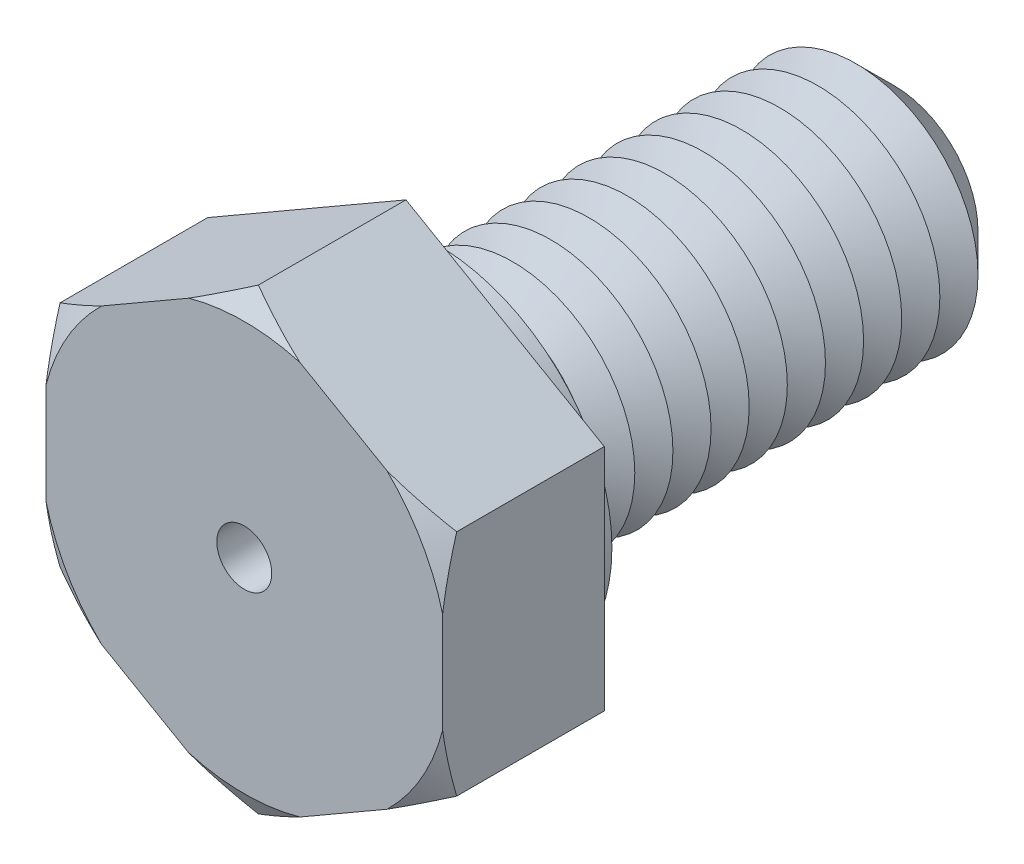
ISO-10303-21;
HEADER;
FILE_DESCRIPTION(('STEP AP214'),'2;1');
FILE_NAME('part.step','',(''),(''),'','','');
FILE_SCHEMA(('AUTOMOTIVE_DESIGN { 1 0 10303 214 1 1 1 1 }'));
ENDSEC;
DATA;
#1=APPLICATION_CONTEXT('core data for automotive mechanical design processes');
#2=APPLICATION_PROTOCOL_DEFINITION('international standard','automotive_design',2000,#1);
#3=PRODUCT_CONTEXT('',#1,'mechanical');
#4=PRODUCT('Part','Part','',(#3));
#5=PRODUCT_RELATED_PRODUCT_CATEGORY('part','',(#4));
#6=PRODUCT_DEFINITION_FORMATION('','',#4);
#7=PRODUCT_DEFINITION_CONTEXT('part definition',#1,'design');
#8=PRODUCT_DEFINITION('design','',#6,#7);
#9=PRODUCT_DEFINITION_SHAPE('','',#8);
#10=(LENGTH_UNIT() NAMED_UNIT(*) SI_UNIT(.MILLI.,.METRE.));
#11=(NAMED_UNIT(*) PLANE_ANGLE_UNIT() SI_UNIT($,.RADIAN.));
#12=(NAMED_UNIT(*) SI_UNIT($,.STERADIAN.) SOLID_ANGLE_UNIT());
#13=UNCERTAINTY_MEASURE_WITH_UNIT(LENGTH_MEASURE(1.E-05),#10,'distance_accuracy_value','');
#14=(GEOMETRIC_REPRESENTATION_CONTEXT(3) GLOBAL_UNCERTAINTY_ASSIGNED_CONTEXT((#13)) GLOBAL_UNIT_ASSIGNED_CONTEXT((#10,
#11,#12)) REPRESENTATION_CONTEXT('',''));
#15=CARTESIAN_POINT('',(0.,0.,0.));
#16=DIRECTION('',(0.,0.,1.));
#17=DIRECTION('',(1.,0.,0.));
#18=AXIS2_PLACEMENT_3D('',#15,#16,#17);
#19=CARTESIAN_POINT('',(6.5,3.75277674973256,5.3));
#20=DIRECTION('',(-0.5,-0.866025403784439,0.));
#21=DIRECTION('',(0.866025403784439,-0.5,0.));
#22=AXIS2_PLACEMENT_3D('',#19,#20,#21);
#23=PLANE('',#22);
#24=CARTESIAN_POINT('',(11.0120510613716,1.14774285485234,2.77920306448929));
#25=CARTESIAN_POINT('',(10.8078344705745,1.26564735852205,2.88939185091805));
#26=CARTESIAN_POINT('',(10.6031290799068,1.38383407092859,2.99839128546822));
#27=CARTESIAN_POINT('',(10.1925345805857,1.6208909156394,3.21345290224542));
#28=CARTESIAN_POINT('',(9.98664532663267,1.73976113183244,3.31951471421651));
#29=CARTESIAN_POINT('',(9.57286478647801,1.97865743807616,3.52844955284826));
#30=CARTESIAN_POINT('',(9.36496919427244,2.09868601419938,3.63131124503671));
#31=CARTESIAN_POINT('',(8.9476201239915,2.33964261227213,3.83272114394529));
#32=CARTESIAN_POINT('',(8.73816669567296,2.46057060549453,3.93126948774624));
#33=CARTESIAN_POINT('',(8.31210847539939,2.70655543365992,4.12554493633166));
#34=CARTESIAN_POINT('',(8.0954571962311,2.83163910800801,4.22113674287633));
#35=CARTESIAN_POINT('',(7.65996896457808,3.0830683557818,4.40550790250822));
#36=CARTESIAN_POINT('',(7.44113190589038,3.2094139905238,4.49428692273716));
#37=CARTESIAN_POINT('',(7.00122142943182,3.46339642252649,4.66334180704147));
#38=CARTESIAN_POINT('',(6.78015039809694,3.59103184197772,4.74362587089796));
#39=CARTESIAN_POINT('',(6.3354128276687,3.8478011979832,4.89383693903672));
#40=CARTESIAN_POINT('',(6.11174662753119,3.97693493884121,4.96376527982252));
#41=CARTESIAN_POINT('',(5.57683009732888,4.2857691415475,5.11501441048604));
#42=CARTESIAN_POINT('',(5.26433342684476,4.46618917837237,5.19069976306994));
#43=CARTESIAN_POINT('',(4.79238520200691,4.73866861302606,5.28165255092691));
#44=CARTESIAN_POINT('',(4.63453792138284,4.82980178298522,5.30820735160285));
#45=CARTESIAN_POINT('',(4.31797843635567,5.01256748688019,5.35312391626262));
#46=CARTESIAN_POINT('',(4.15926635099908,5.10419995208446,5.37148678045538));
#47=CARTESIAN_POINT('',(3.84309853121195,5.28673952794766,5.3993333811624));
#48=CARTESIAN_POINT('',(3.68564943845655,5.37764280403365,5.40891715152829));
#49=CARTESIAN_POINT('',(3.37053331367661,5.55957518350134,5.41928234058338));
#50=CARTESIAN_POINT('',(3.21286628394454,5.65060428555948,5.42006385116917));
#51=CARTESIAN_POINT('',(2.89768626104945,5.83257355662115,5.4127996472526));
#52=CARTESIAN_POINT('',(2.74017326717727,5.92351372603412,5.40475397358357));
#53=CARTESIAN_POINT('',(2.42563627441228,6.10511174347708,5.38007889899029));
#54=CARTESIAN_POINT('',(2.26861235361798,6.19576954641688,5.36344819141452));
#55=CARTESIAN_POINT('',(1.8976455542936,6.40994732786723,5.31443879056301));
#56=CARTESIAN_POINT('',(1.6840512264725,6.53326607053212,5.27851525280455));
#57=CARTESIAN_POINT('',(1.25890710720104,6.77872314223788,5.19313397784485));
#58=CARTESIAN_POINT('',(1.04735761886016,6.90086129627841,5.14367426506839));
#59=CARTESIAN_POINT('',(0.626329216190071,7.14394215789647,5.03308780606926));
#60=CARTESIAN_POINT('',(0.416852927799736,7.26488334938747,4.97194786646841));
#61=CARTESIAN_POINT('',(0.000251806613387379,7.50540811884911,4.83992704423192));
#62=CARTESIAN_POINT('',(-0.206873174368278,7.62499178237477,4.76904677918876));
#63=CARTESIAN_POINT('',(-0.621367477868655,7.86430018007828,4.61833709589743));
#64=CARTESIAN_POINT('',(-0.828710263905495,7.98400959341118,4.53841104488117));
#65=CARTESIAN_POINT('',(-1.2411992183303,8.22216020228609,4.3718486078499));
#66=CARTESIAN_POINT('',(-1.44634674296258,8.34060218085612,4.2852166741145));
#67=CARTESIAN_POINT('',(-1.85477207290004,8.57640665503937,4.10643213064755));
#68=CARTESIAN_POINT('',(-2.05805026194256,8.69376937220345,4.01428068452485));
#69=CARTESIAN_POINT('',(-2.46301289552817,8.92757465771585,3.82542322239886));
#70=CARTESIAN_POINT('',(-2.66469731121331,9.04401720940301,3.72871712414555));
#71=CARTESIAN_POINT('',(-3.00477721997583,9.24036243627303,3.56190249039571));
#72=CARTESIAN_POINT('',(-3.14353507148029,9.32047431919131,3.49277477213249));
#73=CARTESIAN_POINT('',(-3.42044427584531,9.48034792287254,3.35293264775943));
#74=CARTESIAN_POINT('',(-3.55859564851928,9.56010965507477,3.28221829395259));
#75=CARTESIAN_POINT('',(-3.83290330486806,9.71848125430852,3.14014092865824));
#76=CARTESIAN_POINT('',(-3.96906528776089,9.79709441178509,3.06879256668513));
#77=CARTESIAN_POINT('',(-4.24090766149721,9.9540426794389,2.92487520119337));
#78=CARTESIAN_POINT('',(-4.37658804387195,10.0323777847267,2.85230617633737));
#79=CARTESIAN_POINT('',(-4.5120510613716,10.1105873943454,2.77920306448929));
#80=B_SPLINE_CURVE_WITH_KNOTS('',3,(#24,#25,#26,#27,#28,#29,#30,#31,#32,#33,#34,#35,#36,#37,#38,
#39,#40,#41,#42,#43,#44,#45,#46,#47,#48,#49,#50,#51,#52,#53,#54,#55,#56,#57,#58,#59,#60,#61,#62,
#63,#64,#65,#66,#67,#68,#69,#70,#71,#72,#73,#74,#75,#76,#77,#78,#79),.UNSPECIFIED.,.F.,.F.,(4,2,
2,2,2,2,2,2,2,2,2,2,2,2,2,2,2,2,2,2,2,2,2,2,2,2,2,4),(0.,0.780858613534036,1.56181520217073,
2.34527979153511,3.12871946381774,3.93206444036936,4.73544864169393,5.53805016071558,
6.34054800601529,7.44542333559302,7.99784254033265,8.55018753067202,9.096157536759,
9.64212184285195,10.1880836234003,10.7341285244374,11.4813961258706,12.2287728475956,
12.9769988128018,13.7251773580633,14.4822772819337,15.2388787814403,15.9953213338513,
16.7517775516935,17.2752695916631,17.7987444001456,18.3167123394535,18.8346893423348),.UNSPECIFIED.);
#81=CARTESIAN_POINT('',(6.5,3.75277674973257,4.83811978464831));
#82=VERTEX_POINT('',#81);
#83=CARTESIAN_POINT('',(4.67682717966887,4.80538606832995,5.3));
#84=VERTEX_POINT('',#83);
#85=EDGE_CURVE('E132',#82,#84,#80,.T.);
#86=ORIENTED_EDGE('',*,*,#85,.F.);
#87=DIRECTION('',(0.,0.,-1.));
#88=VECTOR('',#87,1.);
#89=CARTESIAN_POINT('',(6.5,3.75277674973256,5.3));
#90=LINE('',#89,#88);
#91=CARTESIAN_POINT('',(6.5,3.75277674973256,0.));
#92=VERTEX_POINT('',#91);
#93=EDGE_CURVE('E144',#82,#92,#90,.T.);
#94=ORIENTED_EDGE('',*,*,#93,.T.);
#95=DIRECTION('',(-0.866025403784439,0.5,0.));
#96=VECTOR('',#95,1.);
#97=CARTESIAN_POINT('',(6.5,3.75277674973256,0.));
#98=LINE('',#97,#96);
#99=CARTESIAN_POINT('',(0.,7.50555349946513,0.));
#100=VERTEX_POINT('',#99);
#101=EDGE_CURVE('E236',#92,#100,#98,.T.);
#102=ORIENTED_EDGE('',*,*,#101,.T.);
#103=DIRECTION('',(0.,0.,-1.));
#104=VECTOR('',#103,1.);
#105=CARTESIAN_POINT('',(0.,7.50555349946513,5.3));
#106=LINE('',#105,#104);
#107=CARTESIAN_POINT('',(0.,7.50555349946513,4.83811978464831));
#108=VERTEX_POINT('',#107);
#109=EDGE_CURVE('E179',#108,#100,#106,.T.);
#110=ORIENTED_EDGE('',*,*,#109,.F.);
#111=CARTESIAN_POINT('',(1.82317282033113,6.45294418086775,5.3));
#112=VERTEX_POINT('',#111);
#113=EDGE_CURVE('E151',#112,#108,#80,.T.);
#114=ORIENTED_EDGE('',*,*,#113,.F.);
#115=DIRECTION('',(-0.866025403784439,0.5,0.));
#116=VECTOR('',#115,1.);
#117=CARTESIAN_POINT('',(6.5,3.75277674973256,5.3));
#118=LINE('',#117,#116);
#119=EDGE_CURVE('E148',#84,#112,#118,.T.);
#120=ORIENTED_EDGE('',*,*,#119,.F.);
#121=EDGE_LOOP('',(#86,#94,#102,#110,#114,#120));
#122=FACE_BOUND('',#121,.T.);
#123=ADVANCED_FACE('F39',(#122),#23,.F.);
#124=CARTESIAN_POINT('',(0.,7.50555349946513,5.3));
#125=DIRECTION('',(0.5,-0.866025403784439,0.));
#126=DIRECTION('',(0.866025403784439,0.5,0.));
#127=AXIS2_PLACEMENT_3D('',#124,#125,#126);
#128=PLANE('',#127);
#129=CARTESIAN_POINT('',(4.5120510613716,10.1105873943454,2.77920306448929));
#130=CARTESIAN_POINT('',(4.30783447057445,9.99268289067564,2.88939185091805));
#131=CARTESIAN_POINT('',(4.1031290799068,9.87449617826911,2.99839128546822));
#132=CARTESIAN_POINT('',(3.69253458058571,9.63743933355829,3.21345290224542));
#133=CARTESIAN_POINT('',(3.48664532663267,9.51856911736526,3.31951471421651));
#134=CARTESIAN_POINT('',(3.07286478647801,9.27967281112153,3.52844955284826));
#135=CARTESIAN_POINT('',(2.86496919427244,9.15964423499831,3.63131124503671));
#136=CARTESIAN_POINT('',(2.4476201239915,8.91868763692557,3.83272114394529));
#137=CARTESIAN_POINT('',(2.23816669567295,8.79775964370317,3.93126948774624));
#138=CARTESIAN_POINT('',(1.81210847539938,8.55177481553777,4.12554493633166));
#139=CARTESIAN_POINT('',(1.5954571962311,8.42669114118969,4.22113674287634));
#140=CARTESIAN_POINT('',(1.15996896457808,8.1752618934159,4.40550790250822));
#141=CARTESIAN_POINT('',(0.941131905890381,8.04891625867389,4.49428692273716));
#142=CARTESIAN_POINT('',(0.501221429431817,7.7949338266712,4.66334180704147));
#143=CARTESIAN_POINT('',(0.280150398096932,7.66729840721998,4.74362587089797));
#144=CARTESIAN_POINT('',(-0.164587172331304,7.4105290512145,4.89383693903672));
#145=CARTESIAN_POINT('',(-0.388253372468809,7.28139531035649,4.96376527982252));
#146=CARTESIAN_POINT('',(-0.923169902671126,6.9725611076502,5.11501441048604));
#147=CARTESIAN_POINT('',(-1.23566657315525,6.79214107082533,5.19069976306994));
#148=CARTESIAN_POINT('',(-1.70761479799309,6.51966163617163,5.28165255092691));
#149=CARTESIAN_POINT('',(-1.86546207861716,6.42852846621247,5.30820735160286));
#150=CARTESIAN_POINT('',(-2.18202156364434,6.24576276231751,5.35312391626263));
#151=CARTESIAN_POINT('',(-2.34073364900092,6.15413029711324,5.37148678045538));
#152=CARTESIAN_POINT('',(-2.65690146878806,5.97159072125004,5.3993333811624));
#153=CARTESIAN_POINT('',(-2.81435056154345,5.88068744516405,5.40891715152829));
#154=CARTESIAN_POINT('',(-3.12946668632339,5.69875506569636,5.41928234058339));
#155=CARTESIAN_POINT('',(-3.28713371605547,5.60772596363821,5.42006385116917));
#156=CARTESIAN_POINT('',(-3.60231373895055,5.42575669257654,5.4127996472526));
#157=CARTESIAN_POINT('',(-3.75982673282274,5.33481652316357,5.40475397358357));
#158=CARTESIAN_POINT('',(-4.07436372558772,5.15321850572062,5.38007889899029));
#159=CARTESIAN_POINT('',(-4.23138764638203,5.06256070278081,5.36344819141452));
#160=CARTESIAN_POINT('',(-4.60235444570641,4.84838292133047,5.31443879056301));
#161=CARTESIAN_POINT('',(-4.81594877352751,4.72506417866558,5.27851525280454));
#162=CARTESIAN_POINT('',(-5.24109289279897,4.47960710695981,5.19313397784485));
#163=CARTESIAN_POINT('',(-5.45264238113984,4.35746895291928,5.14367426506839));
#164=CARTESIAN_POINT('',(-5.87367078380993,4.11438809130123,5.03308780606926));
#165=CARTESIAN_POINT('',(-6.08314707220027,3.99344689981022,4.97194786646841));
#166=CARTESIAN_POINT('',(-6.49974819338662,3.75292213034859,4.83992704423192));
#167=CARTESIAN_POINT('',(-6.70687317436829,3.63333846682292,4.76904677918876));
#168=CARTESIAN_POINT('',(-7.12136747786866,3.39403006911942,4.61833709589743));
#169=CARTESIAN_POINT('',(-7.3287102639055,3.27432065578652,4.53841104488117));
#170=CARTESIAN_POINT('',(-7.74119921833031,3.03617004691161,4.3718486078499));
#171=CARTESIAN_POINT('',(-7.94634674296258,2.91772806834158,4.2852166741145));
#172=CARTESIAN_POINT('',(-8.35477207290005,2.68192359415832,4.10643213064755));
#173=CARTESIAN_POINT('',(-8.55805026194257,2.56456087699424,4.01428068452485));
#174=CARTESIAN_POINT('',(-8.96301289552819,2.33075559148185,3.82542322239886));
#175=CARTESIAN_POINT('',(-9.16469731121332,2.21431303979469,3.72871712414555));
#176=CARTESIAN_POINT('',(-9.50477721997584,2.01796781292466,3.5619024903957));
#177=CARTESIAN_POINT('',(-9.6435350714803,1.93785593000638,3.49277477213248));
#178=CARTESIAN_POINT('',(-9.92044427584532,1.77798232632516,3.35293264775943));
#179=CARTESIAN_POINT('',(-10.0585956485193,1.69822059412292,3.28221829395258));
#180=CARTESIAN_POINT('',(-10.3329033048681,1.53984899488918,3.14014092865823));
#181=CARTESIAN_POINT('',(-10.4690652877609,1.46123583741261,3.06879256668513));
#182=CARTESIAN_POINT('',(-10.7409076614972,1.3042875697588,2.92487520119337));
#183=CARTESIAN_POINT('',(-10.876588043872,1.225952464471,2.85230617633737));
#184=CARTESIAN_POINT('',(-11.0120510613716,1.14774285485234,2.77920306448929));
#185=B_SPLINE_CURVE_WITH_KNOTS('',3,(#129,#130,#131,#132,#133,#134,#135,#136,#137,#138,#139,
#140,#141,#142,#143,#144,#145,#146,#147,#148,#149,#150,#151,#152,#153,#154,#155,#156,#157,#158,
#159,#160,#161,#162,#163,#164,#165,#166,#167,#168,#169,#170,#171,#172,#173,#174,#175,#176,#177,
#178,#179,#180,#181,#182,#183,#184),.UNSPECIFIED.,.F.,.F.,(4,2,2,2,2,2,2,2,2,2,2,2,2,2,2,2,2,2,
2,2,2,2,2,2,2,2,2,4),(0.,0.780858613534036,1.56181520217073,2.34527979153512,3.12871946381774,
3.93206444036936,4.73544864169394,5.53805016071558,6.34054800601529,7.44542333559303,
7.99784254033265,8.55018753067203,9.096157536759,9.64212184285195,10.1880836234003,
10.7341285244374,11.4813961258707,12.2287728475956,12.9769988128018,13.7251773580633,
14.4822772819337,15.2388787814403,15.9953213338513,16.7517775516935,17.2752695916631,
17.7987444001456,18.3167123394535,18.8346893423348),.UNSPECIFIED.);
#186=CARTESIAN_POINT('',(-1.82317282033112,6.45294418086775,5.3));
#187=VERTEX_POINT('',#186);
#188=EDGE_CURVE('E359',#108,#187,#185,.T.);
#189=ORIENTED_EDGE('',*,*,#188,.F.);
#190=ORIENTED_EDGE('',*,*,#109,.T.);
#191=DIRECTION('',(-0.866025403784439,-0.5,0.));
#192=VECTOR('',#191,1.);
#193=CARTESIAN_POINT('',(0.,7.50555349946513,0.));
#194=LINE('',#193,#192);
#195=CARTESIAN_POINT('',(-6.5,3.75277674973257,0.));
#196=VERTEX_POINT('',#195);
#197=EDGE_CURVE('E239',#100,#196,#194,.T.);
#198=ORIENTED_EDGE('',*,*,#197,.T.);
#199=DIRECTION('',(0.,0.,-1.));
#200=VECTOR('',#199,1.);
#201=CARTESIAN_POINT('',(-6.5,3.75277674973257,5.3));
#202=LINE('',#201,#200);
#203=CARTESIAN_POINT('',(-6.5,3.75277674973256,4.83811978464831));
#204=VERTEX_POINT('',#203);
#205=EDGE_CURVE('E176',#204,#196,#202,.T.);
#206=ORIENTED_EDGE('',*,*,#205,.F.);
#207=CARTESIAN_POINT('',(-4.67682717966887,4.80538606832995,5.3));
#208=VERTEX_POINT('',#207);
#209=EDGE_CURVE('E351',#208,#204,#185,.T.);
#210=ORIENTED_EDGE('',*,*,#209,.F.);
#211=DIRECTION('',(-0.866025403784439,-0.5,0.));
#212=VECTOR('',#211,1.);
#213=CARTESIAN_POINT('',(0.,7.50555349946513,5.3));
#214=LINE('',#213,#212);
#215=EDGE_CURVE('E213',#187,#208,#214,.T.);
#216=ORIENTED_EDGE('',*,*,#215,.F.);
#217=EDGE_LOOP('',(#189,#190,#198,#206,#210,#216));
#218=FACE_BOUND('',#217,.T.);
#219=ADVANCED_FACE('F365',(#218),#128,.F.);
#220=CARTESIAN_POINT('',(-6.5,3.75277674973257,5.3));
#221=DIRECTION('',(1.,0.,0.));
#222=DIRECTION('',(0.,0.,-1.));
#223=AXIS2_PLACEMENT_3D('',#220,#221,#222);
#224=PLANE('',#223);
#225=CARTESIAN_POINT('',(-6.5,8.26482781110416,3.10083044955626));
#226=CARTESIAN_POINT('',(-6.5,8.03000458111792,3.20736842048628));
#227=CARTESIAN_POINT('',(-6.5,7.79453887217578,3.31251727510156));
#228=CARTESIAN_POINT('',(-6.5,7.32204728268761,3.51936269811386));
#229=CARTESIAN_POINT('',(-6.5,7.08502112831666,3.62105864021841));
#230=CARTESIAN_POINT('',(-6.5,6.6082238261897,3.82070151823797));
#231=CARTESIAN_POINT('',(-6.5,6.36844534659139,3.91863101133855));
#232=CARTESIAN_POINT('',(-6.5,5.88686103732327,4.10935828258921));
#233=CARTESIAN_POINT('',(-6.5,5.64505530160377,4.20215629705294));
#234=CARTESIAN_POINT('',(-6.5,5.16020806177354,4.38107583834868));
#235=CARTESIAN_POINT('',(-6.5,4.91717698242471,4.46722547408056));
#236=CARTESIAN_POINT('',(-6.5,4.42851680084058,4.63190822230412));
#237=CARTESIAN_POINT('',(-6.5,4.18288757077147,4.71044095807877));
#238=CARTESIAN_POINT('',(-6.5,3.68915983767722,4.85808723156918));
#239=CARTESIAN_POINT('',(-6.5,3.44106517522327,4.9272135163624));
#240=CARTESIAN_POINT('',(-6.5,2.94198131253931,5.05420795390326));
#241=CARTESIAN_POINT('',(-6.5,2.69099223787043,5.1120765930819));
#242=CARTESIAN_POINT('',(-6.5,2.25769005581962,5.19995201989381));
#243=CARTESIAN_POINT('',(-6.5,2.07603591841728,5.23320954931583));
#244=CARTESIAN_POINT('',(-6.5,1.71151122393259,5.29207741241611));
#245=CARTESIAN_POINT('',(-6.5,1.52864087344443,5.31768901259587));
#246=CARTESIAN_POINT('',(-6.5,1.16195360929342,5.36059506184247));
#247=CARTESIAN_POINT('',(-6.5,0.978136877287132,5.37789105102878));
#248=CARTESIAN_POINT('',(-6.5,0.609880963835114,5.40367049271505));
#249=CARTESIAN_POINT('',(-6.5,0.425441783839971,5.41215396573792));
#250=CARTESIAN_POINT('',(-6.5,0.0564612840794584,5.42004368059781));
#251=CARTESIAN_POINT('',(-6.5,-0.128079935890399,5.41945454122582));
#252=CARTESIAN_POINT('',(-6.5,-0.49690745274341,5.40922941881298));
#253=CARTESIAN_POINT('',(-6.5,-0.681193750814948,5.39959347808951));
#254=CARTESIAN_POINT('',(-6.5,-1.04910266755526,5.37156866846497));
#255=CARTESIAN_POINT('',(-6.5,-1.23272526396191,5.35317950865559));
#256=CARTESIAN_POINT('',(-6.5,-1.5989735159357,5.30817918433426));
#257=CARTESIAN_POINT('',(-6.5,-1.78159898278,5.28156651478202));
#258=CARTESIAN_POINT('',(-6.5,-2.5090476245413,5.16009602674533));
#259=CARTESIAN_POINT('',(-6.5,-3.04897729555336,5.0350728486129));
#260=CARTESIAN_POINT('',(-6.5,-3.8489021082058,4.8122065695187));
#261=CARTESIAN_POINT('',(-6.5,-4.11422810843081,4.73189887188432));
#262=CARTESIAN_POINT('',(-6.5,-4.64182213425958,4.5617271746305));
#263=CARTESIAN_POINT('',(-6.5,-4.90409037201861,4.47186384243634));
#264=CARTESIAN_POINT('',(-6.5,-5.42881258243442,4.28339622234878));
#265=CARTESIAN_POINT('',(-6.5,-5.69123450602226,4.18470387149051));
#266=CARTESIAN_POINT('',(-6.5,-6.21363007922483,3.98100889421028));
#267=CARTESIAN_POINT('',(-6.5,-6.4736035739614,3.87600587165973));
#268=CARTESIAN_POINT('',(-6.5,-6.98982707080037,3.66159357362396));
#269=CARTESIAN_POINT('',(-6.5,-7.24609016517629,3.55221565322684));
#270=CARTESIAN_POINT('',(-6.5,-7.75676014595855,3.32937132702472));
#271=CARTESIAN_POINT('',(-6.5,-8.0111674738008,3.21590593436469));
#272=CARTESIAN_POINT('',(-6.5,-8.26482781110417,3.10083044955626));
#273=B_SPLINE_CURVE_WITH_KNOTS('',3,(#225,#226,#227,#228,#229,#230,#231,#232,#233,#234,#235,
#236,#237,#238,#239,#240,#241,#242,#243,#244,#245,#246,#247,#248,#249,#250,#251,#252,#253,#254,
#255,#256,#257,#258,#259,#260,#261,#262,#263,#264,#265,#266,#267,#268,#269,#270,#271,#272),
.UNSPECIFIED.,.F.,.F.,(4,2,2,2,2,2,2,2,2,2,2,2,2,2,2,2,2,2,2,2,2,2,2,4),(0.,0.773595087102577,
1.54732974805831,2.3242977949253,3.10123003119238,3.87467353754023,4.64815527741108,
5.42057817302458,6.19296768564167,6.74684672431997,7.30063396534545,7.85431860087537,
8.40800194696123,8.96140342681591,9.51480231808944,10.0682196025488,10.621738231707,
12.2804682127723,13.1120468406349,13.9435674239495,14.7845791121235,15.625643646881,
16.4614935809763,17.2971377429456),.UNSPECIFIED.);
#274=CARTESIAN_POINT('',(-6.5,1.64755811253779,5.3));
#275=VERTEX_POINT('',#274);
#276=EDGE_CURVE('E220',#204,#275,#273,.T.);
#277=ORIENTED_EDGE('',*,*,#276,.F.);
#278=ORIENTED_EDGE('',*,*,#205,.T.);
#279=DIRECTION('',(0.,-1.,0.));
#280=VECTOR('',#279,1.);
#281=CARTESIAN_POINT('',(-6.5,3.75277674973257,0.));
#282=LINE('',#281,#280);
#283=CARTESIAN_POINT('',(-6.5,-3.75277674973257,0.));
#284=VERTEX_POINT('',#283);
#285=EDGE_CURVE('E244',#196,#284,#282,.T.);
#286=ORIENTED_EDGE('',*,*,#285,.T.);
#287=DIRECTION('',(0.,0.,-1.));
#288=VECTOR('',#287,1.);
#289=CARTESIAN_POINT('',(-6.5,-3.75277674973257,5.3));
#290=LINE('',#289,#288);
#291=CARTESIAN_POINT('',(-6.49999999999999,-3.75277674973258,4.83811978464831));
#292=VERTEX_POINT('',#291);
#293=EDGE_CURVE('E173',#292,#284,#290,.T.);
#294=ORIENTED_EDGE('',*,*,#293,.F.);
#295=CARTESIAN_POINT('',(-6.5,-1.64755811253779,5.3));
#296=VERTEX_POINT('',#295);
#297=EDGE_CURVE('E223',#296,#292,#273,.T.);
#298=ORIENTED_EDGE('',*,*,#297,.F.);
#299=DIRECTION('',(0.,-1.,0.));
#300=VECTOR('',#299,1.);
#301=CARTESIAN_POINT('',(-6.5,3.75277674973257,5.3));
#302=LINE('',#301,#300);
#303=EDGE_CURVE('E211',#275,#296,#302,.T.);
#304=ORIENTED_EDGE('',*,*,#303,.F.);
#305=EDGE_LOOP('',(#277,#278,#286,#294,#298,#304));
#306=FACE_BOUND('',#305,.T.);
#307=ADVANCED_FACE('F219',(#306),#224,.F.);
#308=CARTESIAN_POINT('',(-6.5,-3.75277674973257,5.3));
#309=DIRECTION('',(0.5,0.866025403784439,0.));
#310=DIRECTION('',(-0.866025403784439,0.5,0.));
#311=AXIS2_PLACEMENT_3D('',#308,#309,#310);
#312=PLANE('',#311);
#313=CARTESIAN_POINT('',(-11.0120510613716,-1.14774285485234,2.77920306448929));
#314=CARTESIAN_POINT('',(-10.8078344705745,-1.26564735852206,2.88939185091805));
#315=CARTESIAN_POINT('',(-10.6031290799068,-1.3838340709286,2.99839128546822));
#316=CARTESIAN_POINT('',(-10.1925345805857,-1.62089091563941,3.21345290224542));
#317=CARTESIAN_POINT('',(-9.98664532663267,-1.73976113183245,3.31951471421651));
#318=CARTESIAN_POINT('',(-9.572864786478,-1.97865743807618,3.52844955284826));
#319=CARTESIAN_POINT('',(-9.36496919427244,-2.09868601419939,3.63131124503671));
#320=CARTESIAN_POINT('',(-8.94762012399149,-2.33964261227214,3.83272114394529));
#321=CARTESIAN_POINT('',(-8.73816669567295,-2.46057060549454,3.93126948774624));
#322=CARTESIAN_POINT('',(-8.31210847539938,-2.70655543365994,4.12554493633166));
#323=CARTESIAN_POINT('',(-8.0954571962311,-2.83163910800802,4.22113674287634));
#324=CARTESIAN_POINT('',(-7.65996896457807,-3.08306835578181,4.40550790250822));
#325=CARTESIAN_POINT('',(-7.44113190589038,-3.20941399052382,4.49428692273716));
#326=CARTESIAN_POINT('',(-7.00122142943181,-3.46339642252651,4.66334180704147));
#327=CARTESIAN_POINT('',(-6.78015039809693,-3.59103184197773,4.74362587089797));
#328=CARTESIAN_POINT('',(-6.33541282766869,-3.84780119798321,4.89383693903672));
#329=CARTESIAN_POINT('',(-6.11174662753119,-3.97693493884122,4.96376527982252));
#330=CARTESIAN_POINT('',(-5.57683009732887,-4.28576914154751,5.11501441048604));
#331=CARTESIAN_POINT('',(-5.26433342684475,-4.46618917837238,5.19069976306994));
#332=CARTESIAN_POINT('',(-4.7923852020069,-4.73866861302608,5.28165255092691));
#333=CARTESIAN_POINT('',(-4.63453792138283,-4.82980178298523,5.30820735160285));
#334=CARTESIAN_POINT('',(-4.31797843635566,-5.0125674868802,5.35312391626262));
#335=CARTESIAN_POINT('',(-4.15926635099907,-5.10419995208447,5.37148678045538));
#336=CARTESIAN_POINT('',(-3.84309853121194,-5.28673952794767,5.39933338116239));
#337=CARTESIAN_POINT('',(-3.68564943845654,-5.37764280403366,5.40891715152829));
#338=CARTESIAN_POINT('',(-3.3705333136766,-5.55957518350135,5.41928234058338));
#339=CARTESIAN_POINT('',(-3.21286628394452,-5.6506042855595,5.42006385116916));
#340=CARTESIAN_POINT('',(-2.89768626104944,-5.83257355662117,5.41279964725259));
#341=CARTESIAN_POINT('',(-2.74017326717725,-5.92351372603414,5.40475397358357));
#342=CARTESIAN_POINT('',(-2.42563627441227,-6.1051117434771,5.38007889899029));
#343=CARTESIAN_POINT('',(-2.26861235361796,-6.1957695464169,5.36344819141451));
#344=CARTESIAN_POINT('',(-1.89764555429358,-6.40994732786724,5.314438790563));
#345=CARTESIAN_POINT('',(-1.68405122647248,-6.53326607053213,5.27851525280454));
#346=CARTESIAN_POINT('',(-1.25890710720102,-6.7787231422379,5.19313397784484));
#347=CARTESIAN_POINT('',(-1.04735761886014,-6.90086129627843,5.14367426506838));
#348=CARTESIAN_POINT('',(-0.626329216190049,-7.14394215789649,5.03308780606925));
#349=CARTESIAN_POINT('',(-0.416852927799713,-7.26488334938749,4.9719478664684));
#350=CARTESIAN_POINT('',(-0.000251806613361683,-7.50540811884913,4.83992704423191));
#351=CARTESIAN_POINT('',(0.206873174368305,-7.62499178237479,4.76904677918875));
#352=CARTESIAN_POINT('',(0.621367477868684,-7.8643001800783,4.61833709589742));
#353=CARTESIAN_POINT('',(0.828710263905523,-7.9840095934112,4.53841104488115));
#354=CARTESIAN_POINT('',(1.24119921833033,-8.22216020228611,4.37184860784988));
#355=CARTESIAN_POINT('',(1.44634674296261,-8.34060218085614,4.28521667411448));
#356=CARTESIAN_POINT('',(1.85477207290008,-8.5764066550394,4.10643213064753));
#357=CARTESIAN_POINT('',(2.0580502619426,-8.69376937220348,4.01428068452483));
#358=CARTESIAN_POINT('',(2.46301289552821,-8.92757465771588,3.82542322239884));
#359=CARTESIAN_POINT('',(2.66469731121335,-9.04401720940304,3.72871712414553));
#360=CARTESIAN_POINT('',(3.00477721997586,-9.24036243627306,3.56190249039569));
#361=CARTESIAN_POINT('',(3.14353507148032,-9.32047431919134,3.49277477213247));
#362=CARTESIAN_POINT('',(3.42044427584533,-9.48034792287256,3.35293264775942));
#363=CARTESIAN_POINT('',(3.55859564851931,-9.56010965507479,3.28221829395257));
#364=CARTESIAN_POINT('',(3.83290330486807,-9.71848125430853,3.14014092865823));
#365=CARTESIAN_POINT('',(3.9690652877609,-9.7970944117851,3.06879256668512));
#366=CARTESIAN_POINT('',(4.24090766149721,-9.9540426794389,2.92487520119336));
#367=CARTESIAN_POINT('',(4.37658804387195,-10.0323777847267,2.85230617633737));
#368=CARTESIAN_POINT('',(4.51205106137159,-10.1105873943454,2.77920306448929));
#369=B_SPLINE_CURVE_WITH_KNOTS('',3,(#313,#314,#315,#316,#317,#318,#319,#320,#321,#322,#323,
#324,#325,#326,#327,#328,#329,#330,#331,#332,#333,#334,#335,#336,#337,#338,#339,#340,#341,#342,
#343,#344,#345,#346,#347,#348,#349,#350,#351,#352,#353,#354,#355,#356,#357,#358,#359,#360,#361,
#362,#363,#364,#365,#366,#367,#368),.UNSPECIFIED.,.F.,.F.,(4,2,2,2,2,2,2,2,2,2,2,2,2,2,2,2,2,2,
2,2,2,2,2,2,2,2,2,4),(0.,0.780858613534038,1.56181520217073,2.34527979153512,3.12871946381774,
3.93206444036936,4.73544864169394,5.53805016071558,6.3405480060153,7.44542333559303,
7.99784254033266,8.55018753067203,9.09615753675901,9.64212184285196,10.1880836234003,
10.7341285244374,11.4813961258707,12.2287728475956,12.9769988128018,13.7251773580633,
14.4822772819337,15.2388787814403,15.9953213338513,16.7517775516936,17.2752695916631,
17.7987444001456,18.3167123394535,18.8346893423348),.UNSPECIFIED.);
#370=CARTESIAN_POINT('',(-4.67682717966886,-4.80538606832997,5.3));
#371=VERTEX_POINT('',#370);
#372=EDGE_CURVE('E402',#292,#371,#369,.T.);
#373=ORIENTED_EDGE('',*,*,#372,.F.);
#374=ORIENTED_EDGE('',*,*,#293,.T.);
#375=DIRECTION('',(0.866025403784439,-0.5,0.));
#376=VECTOR('',#375,1.);
#377=CARTESIAN_POINT('',(-6.5,-3.75277674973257,0.));
#378=LINE('',#377,#376);
#379=CARTESIAN_POINT('',(0.,-7.50555349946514,0.));
#380=VERTEX_POINT('',#379);
#381=EDGE_CURVE('E248',#284,#380,#378,.T.);
#382=ORIENTED_EDGE('',*,*,#381,.T.);
#383=DIRECTION('',(0.,0.,-1.));
#384=VECTOR('',#383,1.);
#385=CARTESIAN_POINT('',(0.,-7.50555349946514,5.3));
#386=LINE('',#385,#384);
#387=CARTESIAN_POINT('',(0.,-7.50555349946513,4.83811978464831));
#388=VERTEX_POINT('',#387);
#389=EDGE_CURVE('E163',#388,#380,#386,.T.);
#390=ORIENTED_EDGE('',*,*,#389,.F.);
#391=CARTESIAN_POINT('',(-1.82317282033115,-6.45294418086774,5.3));
#392=VERTEX_POINT('',#391);
#393=EDGE_CURVE('E396',#392,#388,#369,.T.);
#394=ORIENTED_EDGE('',*,*,#393,.F.);
#395=DIRECTION('',(0.866025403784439,-0.5,0.));
#396=VECTOR('',#395,1.);
#397=CARTESIAN_POINT('',(-6.5,-3.75277674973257,5.3));
#398=LINE('',#397,#396);
#399=EDGE_CURVE('E225',#371,#392,#398,.T.);
#400=ORIENTED_EDGE('',*,*,#399,.F.);
#401=EDGE_LOOP('',(#373,#374,#382,#390,#394,#400));
#402=FACE_BOUND('',#401,.T.);
#403=ADVANCED_FACE('F403',(#402),#312,.F.);
#404=CARTESIAN_POINT('',(0.,-7.50555349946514,5.3));
#405=DIRECTION('',(-0.5,0.866025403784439,0.));
#406=DIRECTION('',(-0.866025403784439,-0.5,0.));
#407=AXIS2_PLACEMENT_3D('',#404,#405,#406);
#408=PLANE('',#407);
#409=CARTESIAN_POINT('',(-4.5120510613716,-10.1105873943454,2.77920306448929));
#410=CARTESIAN_POINT('',(-4.30783447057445,-9.99268289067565,2.88939185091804));
#411=CARTESIAN_POINT('',(-4.1031290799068,-9.87449617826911,2.99839128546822));
#412=CARTESIAN_POINT('',(-3.69253458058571,-9.6374393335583,3.21345290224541));
#413=CARTESIAN_POINT('',(-3.48664532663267,-9.51856911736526,3.3195147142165));
#414=CARTESIAN_POINT('',(-3.072864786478,-9.27967281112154,3.52844955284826));
#415=CARTESIAN_POINT('',(-2.86496919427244,-9.15964423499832,3.6313112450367));
#416=CARTESIAN_POINT('',(-2.4476201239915,-8.91868763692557,3.83272114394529));
#417=CARTESIAN_POINT('',(-2.23816669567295,-8.79775964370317,3.93126948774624));
#418=CARTESIAN_POINT('',(-1.81210847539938,-8.55177481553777,4.12554493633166));
#419=CARTESIAN_POINT('',(-1.5954571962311,-8.42669114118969,4.22113674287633));
#420=CARTESIAN_POINT('',(-1.15996896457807,-8.1752618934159,4.40550790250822));
#421=CARTESIAN_POINT('',(-0.941131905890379,-8.04891625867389,4.49428692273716));
#422=CARTESIAN_POINT('',(-0.501221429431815,-7.79493382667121,4.66334180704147));
#423=CARTESIAN_POINT('',(-0.28015039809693,-7.66729840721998,4.74362587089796));
#424=CARTESIAN_POINT('',(0.164587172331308,-7.4105290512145,4.89383693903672));
#425=CARTESIAN_POINT('',(0.388253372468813,-7.28139531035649,4.96376527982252));
#426=CARTESIAN_POINT('',(0.92316990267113,-6.9725611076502,5.11501441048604));
#427=CARTESIAN_POINT('',(1.23566657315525,-6.79214107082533,5.19069976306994));
#428=CARTESIAN_POINT('',(1.7076147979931,-6.51966163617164,5.28165255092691));
#429=CARTESIAN_POINT('',(1.86546207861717,-6.42852846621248,5.30820735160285));
#430=CARTESIAN_POINT('',(2.18202156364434,-6.24576276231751,5.35312391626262));
#431=CARTESIAN_POINT('',(2.34073364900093,-6.15413029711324,5.37148678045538));
#432=CARTESIAN_POINT('',(2.65690146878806,-5.97159072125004,5.3993333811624));
#433=CARTESIAN_POINT('',(2.81435056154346,-5.88068744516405,5.40891715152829));
#434=CARTESIAN_POINT('',(3.1294666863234,-5.69875506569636,5.41928234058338));
#435=CARTESIAN_POINT('',(3.28713371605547,-5.60772596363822,5.42006385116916));
#436=CARTESIAN_POINT('',(3.60231373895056,-5.42575669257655,5.41279964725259));
#437=CARTESIAN_POINT('',(3.75982673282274,-5.33481652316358,5.40475397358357));
#438=CARTESIAN_POINT('',(4.07436372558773,-5.15321850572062,5.38007889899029));
#439=CARTESIAN_POINT('',(4.23138764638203,-5.06256070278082,5.36344819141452));
#440=CARTESIAN_POINT('',(4.60235444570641,-4.84838292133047,5.31443879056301));
#441=CARTESIAN_POINT('',(4.81594877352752,-4.72506417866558,5.27851525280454));
#442=CARTESIAN_POINT('',(5.24109289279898,-4.47960710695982,5.19313397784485));
#443=CARTESIAN_POINT('',(5.45264238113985,-4.35746895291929,5.14367426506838));
#444=CARTESIAN_POINT('',(5.87367078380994,-4.11438809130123,5.03308780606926));
#445=CARTESIAN_POINT('',(6.08314707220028,-3.99344689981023,4.9719478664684));
#446=CARTESIAN_POINT('',(6.49974819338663,-3.75292213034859,4.83992704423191));
#447=CARTESIAN_POINT('',(6.7068731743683,-3.63333846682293,4.76904677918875));
#448=CARTESIAN_POINT('',(7.12136747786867,-3.39403006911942,4.61833709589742));
#449=CARTESIAN_POINT('',(7.32871026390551,-3.27432065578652,4.53841104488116));
#450=CARTESIAN_POINT('',(7.74119921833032,-3.03617004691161,4.37184860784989));
#451=CARTESIAN_POINT('',(7.9463467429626,-2.91772806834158,4.28521667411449));
#452=CARTESIAN_POINT('',(8.35477207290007,-2.68192359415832,4.10643213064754));
#453=CARTESIAN_POINT('',(8.55805026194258,-2.56456087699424,4.01428068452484));
#454=CARTESIAN_POINT('',(8.9630128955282,-2.33075559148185,3.82542322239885));
#455=CARTESIAN_POINT('',(9.16469731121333,-2.21431303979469,3.72871712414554));
#456=CARTESIAN_POINT('',(9.50477721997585,-2.01796781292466,3.56190249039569));
#457=CARTESIAN_POINT('',(9.64353507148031,-1.93785593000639,3.49277477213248));
#458=CARTESIAN_POINT('',(9.92044427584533,-1.77798232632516,3.35293264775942));
#459=CARTESIAN_POINT('',(10.0585956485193,-1.69822059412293,3.28221829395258));
#460=CARTESIAN_POINT('',(10.3329033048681,-1.53984899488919,3.14014092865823));
#461=CARTESIAN_POINT('',(10.4690652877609,-1.46123583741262,3.06879256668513));
#462=CARTESIAN_POINT('',(10.7409076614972,-1.30428756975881,2.92487520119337));
#463=CARTESIAN_POINT('',(10.876588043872,-1.22595246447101,2.85230617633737));
#464=CARTESIAN_POINT('',(11.0120510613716,-1.14774285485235,2.77920306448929));
#465=B_SPLINE_CURVE_WITH_KNOTS('',3,(#409,#410,#411,#412,#413,#414,#415,#416,#417,#418,#419,
#420,#421,#422,#423,#424,#425,#426,#427,#428,#429,#430,#431,#432,#433,#434,#435,#436,#437,#438,
#439,#440,#441,#442,#443,#444,#445,#446,#447,#448,#449,#450,#451,#452,#453,#454,#455,#456,#457,
#458,#459,#460,#461,#462,#463,#464),.UNSPECIFIED.,.F.,.F.,(4,2,2,2,2,2,2,2,2,2,2,2,2,2,2,2,2,2,
2,2,2,2,2,2,2,2,2,4),(0.,0.780858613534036,1.56181520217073,2.34527979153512,3.12871946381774,
3.93206444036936,4.73544864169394,5.53805016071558,6.3405480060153,7.44542333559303,
7.99784254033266,8.55018753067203,9.09615753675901,9.64212184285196,10.1880836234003,
10.7341285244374,11.4813961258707,12.2287728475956,12.9769988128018,13.7251773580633,
14.4822772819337,15.2388787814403,15.9953213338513,16.7517775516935,17.2752695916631,
17.7987444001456,18.3167123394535,18.8346893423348),.UNSPECIFIED.);
#466=CARTESIAN_POINT('',(1.82317282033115,-6.45294418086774,5.3));
#467=VERTEX_POINT('',#466);
#468=EDGE_CURVE('E64',#388,#467,#465,.T.);
#469=ORIENTED_EDGE('',*,*,#468,.F.);
#470=ORIENTED_EDGE('',*,*,#389,.T.);
#471=DIRECTION('',(0.866025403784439,0.5,0.));
#472=VECTOR('',#471,1.);
#473=CARTESIAN_POINT('',(0.,-7.50555349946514,0.));
#474=LINE('',#473,#472);
#475=CARTESIAN_POINT('',(6.5,-3.75277674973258,0.));
#476=VERTEX_POINT('',#475);
#477=EDGE_CURVE('E251',#380,#476,#474,.T.);
#478=ORIENTED_EDGE('',*,*,#477,.T.);
#479=DIRECTION('',(0.,0.,-1.));
#480=VECTOR('',#479,1.);
#481=CARTESIAN_POINT('',(6.5,-3.75277674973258,5.3));
#482=LINE('',#481,#480);
#483=CARTESIAN_POINT('',(6.5,-3.75277674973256,4.83811978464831));
#484=VERTEX_POINT('',#483);
#485=EDGE_CURVE('E157',#484,#476,#482,.T.);
#486=ORIENTED_EDGE('',*,*,#485,.F.);
#487=CARTESIAN_POINT('',(4.67682717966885,-4.80538606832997,5.3));
#488=VERTEX_POINT('',#487);
#489=EDGE_CURVE('E391',#488,#484,#465,.T.);
#490=ORIENTED_EDGE('',*,*,#489,.F.);
#491=DIRECTION('',(0.866025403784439,0.5,0.));
#492=VECTOR('',#491,1.);
#493=CARTESIAN_POINT('',(0.,-7.50555349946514,5.3));
#494=LINE('',#493,#492);
#495=EDGE_CURVE('E166',#467,#488,#494,.T.);
#496=ORIENTED_EDGE('',*,*,#495,.F.);
#497=EDGE_LOOP('',(#469,#470,#478,#486,#490,#496));
#498=FACE_BOUND('',#497,.T.);
#499=ADVANCED_FACE('F406',(#498),#408,.F.);
#500=CARTESIAN_POINT('',(6.5,-3.75277674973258,5.3));
#501=DIRECTION('',(-1.,0.,0.));
#502=DIRECTION('',(0.,-1.,0.));
#503=AXIS2_PLACEMENT_3D('',#500,#501,#502);
#504=PLANE('',#503);
#505=CARTESIAN_POINT('',(6.5,-8.26482781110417,3.10083044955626));
#506=CARTESIAN_POINT('',(6.5,-8.03000458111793,3.20736842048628));
#507=CARTESIAN_POINT('',(6.5,-7.79453887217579,3.31251727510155));
#508=CARTESIAN_POINT('',(6.5,-7.32204728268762,3.51936269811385));
#509=CARTESIAN_POINT('',(6.5,-7.08502112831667,3.62105864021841));
#510=CARTESIAN_POINT('',(6.5,-6.60822382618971,3.82070151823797));
#511=CARTESIAN_POINT('',(6.5,-6.3684453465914,3.91863101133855));
#512=CARTESIAN_POINT('',(6.5,-5.88686103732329,4.10935828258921));
#513=CARTESIAN_POINT('',(6.5,-5.64505530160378,4.20215629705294));
#514=CARTESIAN_POINT('',(6.5,-5.16020806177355,4.38107583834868));
#515=CARTESIAN_POINT('',(6.5,-4.91717698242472,4.46722547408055));
#516=CARTESIAN_POINT('',(6.5,-4.42851680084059,4.63190822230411));
#517=CARTESIAN_POINT('',(6.5,-4.18288757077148,4.71044095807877));
#518=CARTESIAN_POINT('',(6.5,-3.68915983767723,4.85808723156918));
#519=CARTESIAN_POINT('',(6.5,-3.44106517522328,4.9272135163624));
#520=CARTESIAN_POINT('',(6.5,-2.94198131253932,5.05420795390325));
#521=CARTESIAN_POINT('',(6.5,-2.69099223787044,5.1120765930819));
#522=CARTESIAN_POINT('',(6.5,-2.25769005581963,5.19995201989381));
#523=CARTESIAN_POINT('',(6.5,-2.07603591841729,5.23320954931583));
#524=CARTESIAN_POINT('',(6.5,-1.7115112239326,5.29207741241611));
#525=CARTESIAN_POINT('',(6.5,-1.52864087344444,5.31768901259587));
#526=CARTESIAN_POINT('',(6.5,-1.16195360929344,5.36059506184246));
#527=CARTESIAN_POINT('',(6.5,-0.978136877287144,5.37789105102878));
#528=CARTESIAN_POINT('',(6.5,-0.609880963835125,5.40367049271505));
#529=CARTESIAN_POINT('',(6.5,-0.425441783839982,5.41215396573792));
#530=CARTESIAN_POINT('',(6.5,-0.056461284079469,5.42004368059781));
#531=CARTESIAN_POINT('',(6.5,0.128079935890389,5.41945454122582));
#532=CARTESIAN_POINT('',(6.5,0.496907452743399,5.40922941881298));
#533=CARTESIAN_POINT('',(6.5,0.681193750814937,5.39959347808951));
#534=CARTESIAN_POINT('',(6.5,1.04910266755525,5.37156866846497));
#535=CARTESIAN_POINT('',(6.5,1.2327252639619,5.35317950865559));
#536=CARTESIAN_POINT('',(6.5,1.59897351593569,5.30817918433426));
#537=CARTESIAN_POINT('',(6.5,1.78159898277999,5.28156651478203));
#538=CARTESIAN_POINT('',(6.5,2.50904762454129,5.16009602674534));
#539=CARTESIAN_POINT('',(6.5,3.04897729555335,5.0350728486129));
#540=CARTESIAN_POINT('',(6.5,3.84890210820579,4.8122065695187));
#541=CARTESIAN_POINT('',(6.5,4.1142281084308,4.73189887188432));
#542=CARTESIAN_POINT('',(6.5,4.64182213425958,4.5617271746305));
#543=CARTESIAN_POINT('',(6.5,4.9040903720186,4.47186384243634));
#544=CARTESIAN_POINT('',(6.5,5.42881258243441,4.28339622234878));
#545=CARTESIAN_POINT('',(6.5,5.69123450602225,4.18470387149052));
#546=CARTESIAN_POINT('',(6.5,6.21363007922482,3.98100889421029));
#547=CARTESIAN_POINT('',(6.5,6.47360357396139,3.87600587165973));
#548=CARTESIAN_POINT('',(6.5,6.98982707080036,3.66159357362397));
#549=CARTESIAN_POINT('',(6.5,7.24609016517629,3.55221565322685));
#550=CARTESIAN_POINT('',(6.5,7.75676014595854,3.32937132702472));
#551=CARTESIAN_POINT('',(6.5,8.01116747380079,3.21590593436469));
#552=CARTESIAN_POINT('',(6.5,8.26482781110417,3.10083044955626));
#553=B_SPLINE_CURVE_WITH_KNOTS('',3,(#505,#506,#507,#508,#509,#510,#511,#512,#513,#514,#515,
#516,#517,#518,#519,#520,#521,#522,#523,#524,#525,#526,#527,#528,#529,#530,#531,#532,#533,#534,
#535,#536,#537,#538,#539,#540,#541,#542,#543,#544,#545,#546,#547,#548,#549,#550,#551,#552),
.UNSPECIFIED.,.F.,.F.,(4,2,2,2,2,2,2,2,2,2,2,2,2,2,2,2,2,2,2,2,2,2,2,4),(0.,0.773595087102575,
1.54732974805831,2.3242977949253,3.10123003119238,3.87467353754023,4.64815527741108,
5.42057817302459,6.19296768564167,6.74684672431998,7.30063396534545,7.85431860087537,
8.40800194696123,8.96140342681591,9.51480231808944,10.0682196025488,10.621738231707,
12.2804682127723,13.1120468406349,13.9435674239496,14.7845791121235,15.625643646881,
16.4614935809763,17.2971377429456),.UNSPECIFIED.);
#554=CARTESIAN_POINT('',(6.5,-1.64755811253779,5.3));
#555=VERTEX_POINT('',#554);
#556=EDGE_CURVE('E56',#484,#555,#553,.T.);
#557=ORIENTED_EDGE('',*,*,#556,.F.);
#558=ORIENTED_EDGE('',*,*,#485,.T.);
#559=DIRECTION('',(0.,1.,0.));
#560=VECTOR('',#559,1.);
#561=CARTESIAN_POINT('',(6.5,-3.75277674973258,0.));
#562=LINE('',#561,#560);
#563=EDGE_CURVE('E154',#476,#92,#562,.T.);
#564=ORIENTED_EDGE('',*,*,#563,.T.);
#565=ORIENTED_EDGE('',*,*,#93,.F.);
#566=CARTESIAN_POINT('',(6.5,1.64755811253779,5.3));
#567=VERTEX_POINT('',#566);
#568=EDGE_CURVE('E129',#567,#82,#553,.T.);
#569=ORIENTED_EDGE('',*,*,#568,.F.);
#570=DIRECTION('',(0.,1.,0.));
#571=VECTOR('',#570,1.);
#572=CARTESIAN_POINT('',(6.5,-3.75277674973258,5.3));
#573=LINE('',#572,#571);
#574=EDGE_CURVE('E158',#555,#567,#573,.T.);
#575=ORIENTED_EDGE('',*,*,#574,.F.);
#576=EDGE_LOOP('',(#557,#558,#564,#565,#569,#575));
#577=FACE_BOUND('',#576,.T.);
#578=ADVANCED_FACE('F152',(#577),#504,.F.);
#579=CARTESIAN_POINT('',(0.,0.,5.3));
#580=DIRECTION('',(0.,0.,1.));
#581=DIRECTION('',(1.,0.,0.));
#582=AXIS2_PLACEMENT_3D('',#579,#580,#581);
#583=PLANE('',#582);
#584=CARTESIAN_POINT('',(0.,0.,5.3));
#585=DIRECTION('',(0.,0.,1.));
#586=DIRECTION('',(1.,0.,0.));
#587=AXIS2_PLACEMENT_3D('',#584,#585,#586);
#588=CIRCLE('',#587,0.9);
#589=CARTESIAN_POINT('',(0.9,0.,5.3));
#590=VERTEX_POINT('',#589);
#591=EDGE_CURVE('E824',#590,#590,#588,.T.);
#592=ORIENTED_EDGE('',*,*,#591,.F.);
#593=EDGE_LOOP('',(#592));
#594=FACE_BOUND('',#593,.T.);
#595=ORIENTED_EDGE('',*,*,#574,.T.);
#596=CARTESIAN_POINT('',(0.,0.,5.3));
#597=DIRECTION('',(0.,0.,1.));
#598=DIRECTION('',(1.,0.,0.));
#599=AXIS2_PLACEMENT_3D('',#596,#597,#598);
#600=CIRCLE('',#599,6.70555349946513);
#601=EDGE_CURVE('E134',#567,#84,#600,.T.);
#602=ORIENTED_EDGE('',*,*,#601,.T.);
#603=ORIENTED_EDGE('',*,*,#119,.T.);
#604=CARTESIAN_POINT('',(0.,0.,5.3));
#605=DIRECTION('',(0.,0.,1.));
#606=DIRECTION('',(1.,0.,0.));
#607=AXIS2_PLACEMENT_3D('',#604,#605,#606);
#608=CIRCLE('',#607,6.70555349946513);
#609=EDGE_CURVE('E11',#112,#187,#608,.T.);
#610=ORIENTED_EDGE('',*,*,#609,.T.);
#611=ORIENTED_EDGE('',*,*,#215,.T.);
#612=EDGE_CURVE('E49',#208,#275,#608,.T.);
#613=ORIENTED_EDGE('',*,*,#612,.T.);
#614=ORIENTED_EDGE('',*,*,#303,.T.);
#615=EDGE_CURVE('E197',#296,#371,#608,.T.);
#616=ORIENTED_EDGE('',*,*,#615,.T.);
#617=ORIENTED_EDGE('',*,*,#399,.T.);
#618=EDGE_CURVE('E192',#392,#467,#608,.T.);
#619=ORIENTED_EDGE('',*,*,#618,.T.);
#620=ORIENTED_EDGE('',*,*,#495,.T.);
#621=EDGE_CURVE('E43',#488,#555,#608,.T.);
#622=ORIENTED_EDGE('',*,*,#621,.T.);
#623=EDGE_LOOP('',(#595,#602,#603,#610,#611,#613,#614,#616,#617,#619,#620,#622));
#624=FACE_BOUND('',#623,.T.);
#625=ADVANCED_FACE('F210',(#594,#624),#583,.T.);
#626=CARTESIAN_POINT('',(0.,0.,0.));
#627=DIRECTION('',(0.,0.,1.));
#628=DIRECTION('',(1.,0.,0.));
#629=AXIS2_PLACEMENT_3D('',#626,#627,#628);
#630=PLANE('',#629);
#631=CARTESIAN_POINT('',(0.,0.,0.));
#632=DIRECTION('',(0.,0.,1.));
#633=DIRECTION('',(1.,0.,0.));
#634=AXIS2_PLACEMENT_3D('',#631,#632,#633);
#635=CIRCLE('',#634,5.75);
#636=CARTESIAN_POINT('',(5.75,0.,0.));
#637=VERTEX_POINT('',#636);
#638=EDGE_CURVE('E182',#637,#637,#635,.F.);
#639=ORIENTED_EDGE('',*,*,#638,.F.);
#640=EDGE_LOOP('',(#639));
#641=FACE_BOUND('',#640,.T.);
#642=ORIENTED_EDGE('',*,*,#101,.F.);
#643=ORIENTED_EDGE('',*,*,#563,.F.);
#644=ORIENTED_EDGE('',*,*,#477,.F.);
#645=ORIENTED_EDGE('',*,*,#381,.F.);
#646=ORIENTED_EDGE('',*,*,#285,.F.);
#647=ORIENTED_EDGE('',*,*,#197,.F.);
#648=EDGE_LOOP('',(#642,#643,#644,#645,#646,#647));
#649=FACE_BOUND('',#648,.T.);
#650=ADVANCED_FACE('F450',(#641,#649),#630,.F.);
#651=CARTESIAN_POINT('',(0.,0.,-1.));
#652=DIRECTION('',(0.,0.,1.));
#653=DIRECTION('',(1.,0.,0.));
#654=AXIS2_PLACEMENT_3D('',#651,#652,#653);
#655=CYLINDRICAL_SURFACE('',#654,5.75);
#656=CARTESIAN_POINT('',(0.,0.,-1.));
#657=DIRECTION('',(0.,0.,-1.));
#658=DIRECTION('',(-1.,0.,0.));
#659=AXIS2_PLACEMENT_3D('',#656,#657,#658);
#660=CIRCLE('',#659,5.75);
#661=CARTESIAN_POINT('',(-5.75,0.,-1.));
#662=VERTEX_POINT('',#661);
#663=EDGE_CURVE('E240',#662,#662,#660,.T.);
#664=ORIENTED_EDGE('',*,*,#663,.F.);
#665=EDGE_LOOP('',(#664));
#666=FACE_BOUND('',#665,.T.);
#667=ORIENTED_EDGE('',*,*,#638,.T.);
#668=EDGE_LOOP('',(#667));
#669=FACE_BOUND('',#668,.T.);
#670=ADVANCED_FACE('F461',(#666,#669),#655,.T.);
#671=CARTESIAN_POINT('',(0.,0.,-1.));
#672=DIRECTION('',(0.,0.,-1.));
#673=DIRECTION('',(-1.,0.,0.));
#674=AXIS2_PLACEMENT_3D('',#671,#672,#673);
#675=PLANE('',#674);
#676=CARTESIAN_POINT('',(0.,0.,-1.));
#677=DIRECTION('',(0.,0.,1.));
#678=DIRECTION('',(1.,0.,0.));
#679=AXIS2_PLACEMENT_3D('',#676,#677,#678);
#680=CIRCLE('',#679,4.);
#681=CARTESIAN_POINT('',(4.,0.,-1.));
#682=VERTEX_POINT('',#681);
#683=EDGE_CURVE('E266',#682,#682,#680,.T.);
#684=ORIENTED_EDGE('',*,*,#683,.T.);
#685=EDGE_LOOP('',(#684));
#686=FACE_BOUND('',#685,.T.);
#687=ORIENTED_EDGE('',*,*,#663,.T.);
#688=EDGE_LOOP('',(#687));
#689=FACE_BOUND('',#688,.T.);
#690=ADVANCED_FACE('F470',(#686,#689),#675,.T.);
#691=CARTESIAN_POINT('',(0.,0.,-1.));
#692=DIRECTION('',(0.,0.,1.));
#693=DIRECTION('',(1.,0.,0.));
#694=AXIS2_PLACEMENT_3D('',#691,#692,#693);
#695=CONICAL_SURFACE('',#694,4.,1.0471975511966);
#696=CARTESIAN_POINT('',(0.,0.,-1.625));
#697=DIRECTION('',(0.,0.,1.));
#698=DIRECTION('',(1.,0.,0.));
#699=AXIS2_PLACEMENT_3D('',#696,#697,#698);
#700=CIRCLE('',#699,2.91746824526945);
#701=CARTESIAN_POINT('',(2.91746824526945,0.,-1.625));
#702=VERTEX_POINT('',#701);
#703=EDGE_CURVE('E270',#702,#702,#700,.T.);
#704=ORIENTED_EDGE('',*,*,#703,.T.);
#705=EDGE_LOOP('',(#704));
#706=FACE_BOUND('',#705,.T.);
#707=ORIENTED_EDGE('',*,*,#683,.F.);
#708=EDGE_LOOP('',(#707));
#709=FACE_BOUND('',#708,.T.);
#710=ADVANCED_FACE('F479',(#706,#709),#695,.T.);
#711=CARTESIAN_POINT('',(0.,0.,-1.625));
#712=DIRECTION('',(0.,0.,-1.));
#713=DIRECTION('',(-1.,0.,0.));
#714=AXIS2_PLACEMENT_3D('',#711,#712,#713);
#715=CONICAL_SURFACE('',#714,2.91746824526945,1.0471975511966);
#716=CARTESIAN_POINT('',(0.,0.,-2.25));
#717=DIRECTION('',(0.,0.,1.));
#718=DIRECTION('',(1.,0.,0.));
#719=AXIS2_PLACEMENT_3D('',#716,#717,#718);
#720=CIRCLE('',#719,4.);
#721=CARTESIAN_POINT('',(4.,0.,-2.25));
#722=VERTEX_POINT('',#721);
#723=EDGE_CURVE('E274',#722,#722,#720,.T.);
#724=ORIENTED_EDGE('',*,*,#723,.T.);
#725=EDGE_LOOP('',(#724));
#726=FACE_BOUND('',#725,.T.);
#727=ORIENTED_EDGE('',*,*,#703,.F.);
#728=EDGE_LOOP('',(#727));
#729=FACE_BOUND('',#728,.T.);
#730=ADVANCED_FACE('F489',(#726,#729),#715,.T.);
#731=CARTESIAN_POINT('',(0.,0.,-2.25));
#732=DIRECTION('',(0.,0.,1.));
#733=DIRECTION('',(1.,0.,0.));
#734=AXIS2_PLACEMENT_3D('',#731,#732,#733);
#735=CONICAL_SURFACE('',#734,4.,1.0471975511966);
#736=CARTESIAN_POINT('',(0.,0.,-2.875));
#737=DIRECTION('',(0.,0.,1.));
#738=DIRECTION('',(1.,0.,0.));
#739=AXIS2_PLACEMENT_3D('',#736,#737,#738);
#740=CIRCLE('',#739,2.91746824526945);
#741=CARTESIAN_POINT('',(2.91746824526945,0.,-2.875));
#742=VERTEX_POINT('',#741);
#743=EDGE_CURVE('E278',#742,#742,#740,.T.);
#744=ORIENTED_EDGE('',*,*,#743,.T.);
#745=EDGE_LOOP('',(#744));
#746=FACE_BOUND('',#745,.T.);
#747=ORIENTED_EDGE('',*,*,#723,.F.);
#748=EDGE_LOOP('',(#747));
#749=FACE_BOUND('',#748,.T.);
#750=ADVANCED_FACE('F498',(#746,#749),#735,.T.);
#751=CARTESIAN_POINT('',(0.,0.,-2.875));
#752=DIRECTION('',(0.,0.,-1.));
#753=DIRECTION('',(-1.,0.,0.));
#754=AXIS2_PLACEMENT_3D('',#751,#752,#753);
#755=CONICAL_SURFACE('',#754,2.91746824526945,1.0471975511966);
#756=CARTESIAN_POINT('',(0.,0.,-3.5));
#757=DIRECTION('',(0.,0.,1.));
#758=DIRECTION('',(1.,0.,0.));
#759=AXIS2_PLACEMENT_3D('',#756,#757,#758);
#760=CIRCLE('',#759,4.);
#761=CARTESIAN_POINT('',(4.,0.,-3.5));
#762=VERTEX_POINT('',#761);
#763=EDGE_CURVE('E282',#762,#762,#760,.T.);
#764=ORIENTED_EDGE('',*,*,#763,.T.);
#765=EDGE_LOOP('',(#764));
#766=FACE_BOUND('',#765,.T.);
#767=ORIENTED_EDGE('',*,*,#743,.F.);
#768=EDGE_LOOP('',(#767));
#769=FACE_BOUND('',#768,.T.);
#770=ADVANCED_FACE('F507',(#766,#769),#755,.T.);
#771=CARTESIAN_POINT('',(0.,0.,-3.5));
#772=DIRECTION('',(0.,0.,1.));
#773=DIRECTION('',(1.,0.,0.));
#774=AXIS2_PLACEMENT_3D('',#771,#772,#773);
#775=CONICAL_SURFACE('',#774,4.,1.0471975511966);
#776=CARTESIAN_POINT('',(0.,0.,-4.125));
#777=DIRECTION('',(0.,0.,1.));
#778=DIRECTION('',(1.,0.,0.));
#779=AXIS2_PLACEMENT_3D('',#776,#777,#778);
#780=CIRCLE('',#779,2.91746824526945);
#781=CARTESIAN_POINT('',(2.91746824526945,0.,-4.125));
#782=VERTEX_POINT('',#781);
#783=EDGE_CURVE('E286',#782,#782,#780,.T.);
#784=ORIENTED_EDGE('',*,*,#783,.T.);
#785=EDGE_LOOP('',(#784));
#786=FACE_BOUND('',#785,.T.);
#787=ORIENTED_EDGE('',*,*,#763,.F.);
#788=EDGE_LOOP('',(#787));
#789=FACE_BOUND('',#788,.T.);
#790=ADVANCED_FACE('F516',(#786,#789),#775,.T.);
#791=CARTESIAN_POINT('',(0.,0.,-4.125));
#792=DIRECTION('',(0.,0.,-1.));
#793=DIRECTION('',(-1.,0.,0.));
#794=AXIS2_PLACEMENT_3D('',#791,#792,#793);
#795=CONICAL_SURFACE('',#794,2.91746824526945,1.0471975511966);
#796=CARTESIAN_POINT('',(0.,0.,-4.75));
#797=DIRECTION('',(0.,0.,1.));
#798=DIRECTION('',(1.,0.,0.));
#799=AXIS2_PLACEMENT_3D('',#796,#797,#798);
#800=CIRCLE('',#799,4.);
#801=CARTESIAN_POINT('',(4.,0.,-4.75));
#802=VERTEX_POINT('',#801);
#803=EDGE_CURVE('E290',#802,#802,#800,.T.);
#804=ORIENTED_EDGE('',*,*,#803,.T.);
#805=EDGE_LOOP('',(#804));
#806=FACE_BOUND('',#805,.T.);
#807=ORIENTED_EDGE('',*,*,#783,.F.);
#808=EDGE_LOOP('',(#807));
#809=FACE_BOUND('',#808,.T.);
#810=ADVANCED_FACE('F525',(#806,#809),#795,.T.);
#811=CARTESIAN_POINT('',(0.,0.,-4.75));
#812=DIRECTION('',(0.,0.,1.));
#813=DIRECTION('',(1.,0.,0.));
#814=AXIS2_PLACEMENT_3D('',#811,#812,#813);
#815=CONICAL_SURFACE('',#814,4.,1.0471975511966);
#816=CARTESIAN_POINT('',(0.,0.,-5.375));
#817=DIRECTION('',(0.,0.,1.));
#818=DIRECTION('',(1.,0.,0.));
#819=AXIS2_PLACEMENT_3D('',#816,#817,#818);
#820=CIRCLE('',#819,2.91746824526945);
#821=CARTESIAN_POINT('',(2.91746824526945,0.,-5.375));
#822=VERTEX_POINT('',#821);
#823=EDGE_CURVE('E293',#822,#822,#820,.T.);
#824=ORIENTED_EDGE('',*,*,#823,.T.);
#825=EDGE_LOOP('',(#824));
#826=FACE_BOUND('',#825,.T.);
#827=ORIENTED_EDGE('',*,*,#803,.F.);
#828=EDGE_LOOP('',(#827));
#829=FACE_BOUND('',#828,.T.);
#830=ADVANCED_FACE('F534',(#826,#829),#815,.T.);
#831=CARTESIAN_POINT('',(0.,0.,-5.375));
#832=DIRECTION('',(0.,0.,-1.));
#833=DIRECTION('',(-1.,0.,0.));
#834=AXIS2_PLACEMENT_3D('',#831,#832,#833);
#835=CONICAL_SURFACE('',#834,2.91746824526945,1.0471975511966);
#836=CARTESIAN_POINT('',(0.,0.,-6.));
#837=DIRECTION('',(0.,0.,1.));
#838=DIRECTION('',(1.,0.,0.));
#839=AXIS2_PLACEMENT_3D('',#836,#837,#838);
#840=CIRCLE('',#839,4.);
#841=CARTESIAN_POINT('',(4.,0.,-6.));
#842=VERTEX_POINT('',#841);
#843=EDGE_CURVE('E297',#842,#842,#840,.T.);
#844=ORIENTED_EDGE('',*,*,#843,.T.);
#845=EDGE_LOOP('',(#844));
#846=FACE_BOUND('',#845,.T.);
#847=ORIENTED_EDGE('',*,*,#823,.F.);
#848=EDGE_LOOP('',(#847));
#849=FACE_BOUND('',#848,.T.);
#850=ADVANCED_FACE('F543',(#846,#849),#835,.T.);
#851=CARTESIAN_POINT('',(0.,0.,-6.));
#852=DIRECTION('',(0.,0.,1.));
#853=DIRECTION('',(1.,0.,0.));
#854=AXIS2_PLACEMENT_3D('',#851,#852,#853);
#855=CONICAL_SURFACE('',#854,4.,1.0471975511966);
#856=CARTESIAN_POINT('',(0.,0.,-6.625));
#857=DIRECTION('',(0.,0.,1.));
#858=DIRECTION('',(1.,0.,0.));
#859=AXIS2_PLACEMENT_3D('',#856,#857,#858);
#860=CIRCLE('',#859,2.91746824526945);
#861=CARTESIAN_POINT('',(2.91746824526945,0.,-6.625));
#862=VERTEX_POINT('',#861);
#863=EDGE_CURVE('E300',#862,#862,#860,.T.);
#864=ORIENTED_EDGE('',*,*,#863,.T.);
#865=EDGE_LOOP('',(#864));
#866=FACE_BOUND('',#865,.T.);
#867=ORIENTED_EDGE('',*,*,#843,.F.);
#868=EDGE_LOOP('',(#867));
#869=FACE_BOUND('',#868,.T.);
#870=ADVANCED_FACE('F552',(#866,#869),#855,.T.);
#871=CARTESIAN_POINT('',(0.,0.,-6.625));
#872=DIRECTION('',(0.,0.,-1.));
#873=DIRECTION('',(-1.,0.,0.));
#874=AXIS2_PLACEMENT_3D('',#871,#872,#873);
#875=CONICAL_SURFACE('',#874,2.91746824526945,1.0471975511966);
#876=CARTESIAN_POINT('',(0.,0.,-7.25));
#877=DIRECTION('',(0.,0.,1.));
#878=DIRECTION('',(1.,0.,0.));
#879=AXIS2_PLACEMENT_3D('',#876,#877,#878);
#880=CIRCLE('',#879,4.);
#881=CARTESIAN_POINT('',(4.,0.,-7.25));
#882=VERTEX_POINT('',#881);
#883=EDGE_CURVE('E304',#882,#882,#880,.T.);
#884=ORIENTED_EDGE('',*,*,#883,.T.);
#885=EDGE_LOOP('',(#884));
#886=FACE_BOUND('',#885,.T.);
#887=ORIENTED_EDGE('',*,*,#863,.F.);
#888=EDGE_LOOP('',(#887));
#889=FACE_BOUND('',#888,.T.);
#890=ADVANCED_FACE('F561',(#886,#889),#875,.T.);
#891=CARTESIAN_POINT('',(0.,0.,-7.25));
#892=DIRECTION('',(0.,0.,1.));
#893=DIRECTION('',(1.,0.,0.));
#894=AXIS2_PLACEMENT_3D('',#891,#892,#893);
#895=CONICAL_SURFACE('',#894,4.,1.0471975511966);
#896=CARTESIAN_POINT('',(0.,0.,-7.875));
#897=DIRECTION('',(0.,0.,1.));
#898=DIRECTION('',(1.,0.,0.));
#899=AXIS2_PLACEMENT_3D('',#896,#897,#898);
#900=CIRCLE('',#899,2.91746824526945);
#901=CARTESIAN_POINT('',(2.91746824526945,0.,-7.875));
#902=VERTEX_POINT('',#901);
#903=EDGE_CURVE('E308',#902,#902,#900,.T.);
#904=ORIENTED_EDGE('',*,*,#903,.T.);
#905=EDGE_LOOP('',(#904));
#906=FACE_BOUND('',#905,.T.);
#907=ORIENTED_EDGE('',*,*,#883,.F.);
#908=EDGE_LOOP('',(#907));
#909=FACE_BOUND('',#908,.T.);
#910=ADVANCED_FACE('F570',(#906,#909),#895,.T.);
#911=CARTESIAN_POINT('',(0.,0.,-7.875));
#912=DIRECTION('',(0.,0.,-1.));
#913=DIRECTION('',(-1.,0.,0.));
#914=AXIS2_PLACEMENT_3D('',#911,#912,#913);
#915=CONICAL_SURFACE('',#914,2.91746824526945,1.0471975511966);
#916=CARTESIAN_POINT('',(0.,0.,-8.5));
#917=DIRECTION('',(0.,0.,1.));
#918=DIRECTION('',(1.,0.,0.));
#919=AXIS2_PLACEMENT_3D('',#916,#917,#918);
#920=CIRCLE('',#919,4.);
#921=CARTESIAN_POINT('',(4.,0.,-8.5));
#922=VERTEX_POINT('',#921);
#923=EDGE_CURVE('E311',#922,#922,#920,.T.);
#924=ORIENTED_EDGE('',*,*,#923,.T.);
#925=EDGE_LOOP('',(#924));
#926=FACE_BOUND('',#925,.T.);
#927=ORIENTED_EDGE('',*,*,#903,.F.);
#928=EDGE_LOOP('',(#927));
#929=FACE_BOUND('',#928,.T.);
#930=ADVANCED_FACE('F579',(#926,#929),#915,.T.);
#931=CARTESIAN_POINT('',(0.,0.,-8.5));
#932=DIRECTION('',(0.,0.,1.));
#933=DIRECTION('',(1.,0.,0.));
#934=AXIS2_PLACEMENT_3D('',#931,#932,#933);
#935=CONICAL_SURFACE('',#934,4.,1.0471975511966);
#936=CARTESIAN_POINT('',(0.,0.,-9.125));
#937=DIRECTION('',(0.,0.,1.));
#938=DIRECTION('',(1.,0.,0.));
#939=AXIS2_PLACEMENT_3D('',#936,#937,#938);
#940=CIRCLE('',#939,2.91746824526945);
#941=CARTESIAN_POINT('',(2.91746824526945,0.,-9.125));
#942=VERTEX_POINT('',#941);
#943=EDGE_CURVE('E315',#942,#942,#940,.T.);
#944=ORIENTED_EDGE('',*,*,#943,.T.);
#945=EDGE_LOOP('',(#944));
#946=FACE_BOUND('',#945,.T.);
#947=ORIENTED_EDGE('',*,*,#923,.F.);
#948=EDGE_LOOP('',(#947));
#949=FACE_BOUND('',#948,.T.);
#950=ADVANCED_FACE('F588',(#946,#949),#935,.T.);
#951=CARTESIAN_POINT('',(0.,0.,-9.125));
#952=DIRECTION('',(0.,0.,-1.));
#953=DIRECTION('',(-1.,0.,0.));
#954=AXIS2_PLACEMENT_3D('',#951,#952,#953);
#955=CONICAL_SURFACE('',#954,2.91746824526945,1.0471975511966);
#956=CARTESIAN_POINT('',(0.,0.,-9.75));
#957=DIRECTION('',(0.,0.,1.));
#958=DIRECTION('',(1.,0.,0.));
#959=AXIS2_PLACEMENT_3D('',#956,#957,#958);
#960=CIRCLE('',#959,4.);
#961=CARTESIAN_POINT('',(4.,0.,-9.75));
#962=VERTEX_POINT('',#961);
#963=EDGE_CURVE('E319',#962,#962,#960,.T.);
#964=ORIENTED_EDGE('',*,*,#963,.T.);
#965=EDGE_LOOP('',(#964));
#966=FACE_BOUND('',#965,.T.);
#967=ORIENTED_EDGE('',*,*,#943,.F.);
#968=EDGE_LOOP('',(#967));
#969=FACE_BOUND('',#968,.T.);
#970=ADVANCED_FACE('F597',(#966,#969),#955,.T.);
#971=CARTESIAN_POINT('',(0.,0.,-9.75));
#972=DIRECTION('',(0.,0.,1.));
#973=DIRECTION('',(1.,0.,0.));
#974=AXIS2_PLACEMENT_3D('',#971,#972,#973);
#975=CONICAL_SURFACE('',#974,4.,1.0471975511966);
#976=CARTESIAN_POINT('',(0.,0.,-10.375));
#977=DIRECTION('',(0.,0.,1.));
#978=DIRECTION('',(1.,0.,0.));
#979=AXIS2_PLACEMENT_3D('',#976,#977,#978);
#980=CIRCLE('',#979,2.91746824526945);
#981=CARTESIAN_POINT('',(2.91746824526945,0.,-10.375));
#982=VERTEX_POINT('',#981);
#983=EDGE_CURVE('E322',#982,#982,#980,.T.);
#984=ORIENTED_EDGE('',*,*,#983,.T.);
#985=EDGE_LOOP('',(#984));
#986=FACE_BOUND('',#985,.T.);
#987=ORIENTED_EDGE('',*,*,#963,.F.);
#988=EDGE_LOOP('',(#987));
#989=FACE_BOUND('',#988,.T.);
#990=ADVANCED_FACE('F606',(#986,#989),#975,.T.);
#991=CARTESIAN_POINT('',(0.,0.,-10.375));
#992=DIRECTION('',(0.,0.,-1.));
#993=DIRECTION('',(-1.,0.,0.));
#994=AXIS2_PLACEMENT_3D('',#991,#992,#993);
#995=CONICAL_SURFACE('',#994,2.91746824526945,1.0471975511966);
#996=CARTESIAN_POINT('',(0.,0.,-11.));
#997=DIRECTION('',(0.,0.,1.));
#998=DIRECTION('',(1.,0.,0.));
#999=AXIS2_PLACEMENT_3D('',#996,#997,#998);
#1000=CIRCLE('',#999,4.);
#1001=CARTESIAN_POINT('',(4.,0.,-11.));
#1002=VERTEX_POINT('',#1001);
#1003=EDGE_CURVE('E326',#1002,#1002,#1000,.T.);
#1004=ORIENTED_EDGE('',*,*,#1003,.T.);
#1005=EDGE_LOOP('',(#1004));
#1006=FACE_BOUND('',#1005,.T.);
#1007=ORIENTED_EDGE('',*,*,#983,.F.);
#1008=EDGE_LOOP('',(#1007));
#1009=FACE_BOUND('',#1008,.T.);
#1010=ADVANCED_FACE('F615',(#1006,#1009),#995,.T.);
#1011=CARTESIAN_POINT('',(0.,0.,-11.));
#1012=DIRECTION('',(0.,0.,1.));
#1013=DIRECTION('',(1.,0.,0.));
#1014=AXIS2_PLACEMENT_3D('',#1011,#1012,#1013);
#1015=CONICAL_SURFACE('',#1014,4.,1.0471975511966);
#1016=CARTESIAN_POINT('',(0.,0.,-11.625));
#1017=DIRECTION('',(0.,0.,1.));
#1018=DIRECTION('',(1.,0.,0.));
#1019=AXIS2_PLACEMENT_3D('',#1016,#1017,#1018);
#1020=CIRCLE('',#1019,2.91746824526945);
#1021=CARTESIAN_POINT('',(2.91746824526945,0.,-11.625));
#1022=VERTEX_POINT('',#1021);
#1023=EDGE_CURVE('E329',#1022,#1022,#1020,.T.);
#1024=ORIENTED_EDGE('',*,*,#1023,.T.);
#1025=EDGE_LOOP('',(#1024));
#1026=FACE_BOUND('',#1025,.T.);
#1027=ORIENTED_EDGE('',*,*,#1003,.F.);
#1028=EDGE_LOOP('',(#1027));
#1029=FACE_BOUND('',#1028,.T.);
#1030=ADVANCED_FACE('F624',(#1026,#1029),#1015,.T.);
#1031=CARTESIAN_POINT('',(0.,0.,-11.625));
#1032=DIRECTION('',(0.,0.,-1.));
#1033=DIRECTION('',(-1.,0.,0.));
#1034=AXIS2_PLACEMENT_3D('',#1031,#1032,#1033);
#1035=CONICAL_SURFACE('',#1034,2.91746824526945,1.0471975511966);
#1036=CARTESIAN_POINT('',(0.,0.,-12.25));
#1037=DIRECTION('',(0.,0.,1.));
#1038=DIRECTION('',(1.,0.,0.));
#1039=AXIS2_PLACEMENT_3D('',#1036,#1037,#1038);
#1040=CIRCLE('',#1039,4.);
#1041=CARTESIAN_POINT('',(4.,0.,-12.25));
#1042=VERTEX_POINT('',#1041);
#1043=EDGE_CURVE('E333',#1042,#1042,#1040,.T.);
#1044=ORIENTED_EDGE('',*,*,#1043,.T.);
#1045=EDGE_LOOP('',(#1044));
#1046=FACE_BOUND('',#1045,.T.);
#1047=ORIENTED_EDGE('',*,*,#1023,.F.);
#1048=EDGE_LOOP('',(#1047));
#1049=FACE_BOUND('',#1048,.T.);
#1050=ADVANCED_FACE('F633',(#1046,#1049),#1035,.T.);
#1051=CARTESIAN_POINT('',(0.,0.,-12.25));
#1052=DIRECTION('',(0.,0.,1.));
#1053=DIRECTION('',(1.,0.,0.));
#1054=AXIS2_PLACEMENT_3D('',#1051,#1052,#1053);
#1055=CONICAL_SURFACE('',#1054,4.,1.0471975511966);
#1056=CARTESIAN_POINT('',(0.,0.,-12.875));
#1057=DIRECTION('',(0.,0.,1.));
#1058=DIRECTION('',(1.,0.,0.));
#1059=AXIS2_PLACEMENT_3D('',#1056,#1057,#1058);
#1060=CIRCLE('',#1059,2.91746824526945);
#1061=CARTESIAN_POINT('',(2.91746824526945,0.,-12.875));
#1062=VERTEX_POINT('',#1061);
#1063=EDGE_CURVE('E336',#1062,#1062,#1060,.T.);
#1064=ORIENTED_EDGE('',*,*,#1063,.T.);
#1065=EDGE_LOOP('',(#1064));
#1066=FACE_BOUND('',#1065,.T.);
#1067=ORIENTED_EDGE('',*,*,#1043,.F.);
#1068=EDGE_LOOP('',(#1067));
#1069=FACE_BOUND('',#1068,.T.);
#1070=ADVANCED_FACE('F642',(#1066,#1069),#1055,.T.);
#1071=CARTESIAN_POINT('',(0.,0.,-12.875));
#1072=DIRECTION('',(0.,0.,-1.));
#1073=DIRECTION('',(-1.,0.,0.));
#1074=AXIS2_PLACEMENT_3D('',#1071,#1072,#1073);
#1075=CONICAL_SURFACE('',#1074,2.91746824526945,1.0471975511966);
#1076=CARTESIAN_POINT('',(0.,0.,-13.5));
#1077=DIRECTION('',(0.,0.,1.));
#1078=DIRECTION('',(1.,0.,0.));
#1079=AXIS2_PLACEMENT_3D('',#1076,#1077,#1078);
#1080=CIRCLE('',#1079,4.);
#1081=CARTESIAN_POINT('',(4.,0.,-13.5));
#1082=VERTEX_POINT('',#1081);
#1083=EDGE_CURVE('E340',#1082,#1082,#1080,.T.);
#1084=ORIENTED_EDGE('',*,*,#1083,.T.);
#1085=EDGE_LOOP('',(#1084));
#1086=FACE_BOUND('',#1085,.T.);
#1087=ORIENTED_EDGE('',*,*,#1063,.F.);
#1088=EDGE_LOOP('',(#1087));
#1089=FACE_BOUND('',#1088,.T.);
#1090=ADVANCED_FACE('F651',(#1086,#1089),#1075,.T.);
#1091=CARTESIAN_POINT('',(0.,0.,-13.5));
#1092=DIRECTION('',(0.,0.,1.));
#1093=DIRECTION('',(1.,0.,0.));
#1094=AXIS2_PLACEMENT_3D('',#1091,#1092,#1093);
#1095=CONICAL_SURFACE('',#1094,4.,1.0471975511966);
#1096=CARTESIAN_POINT('',(0.,0.,-14.125));
#1097=DIRECTION('',(0.,0.,1.));
#1098=DIRECTION('',(1.,0.,0.));
#1099=AXIS2_PLACEMENT_3D('',#1096,#1097,#1098);
#1100=CIRCLE('',#1099,2.91746824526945);
#1101=CARTESIAN_POINT('',(2.91746824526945,0.,-14.125));
#1102=VERTEX_POINT('',#1101);
#1103=EDGE_CURVE('E343',#1102,#1102,#1100,.T.);
#1104=ORIENTED_EDGE('',*,*,#1103,.T.);
#1105=EDGE_LOOP('',(#1104));
#1106=FACE_BOUND('',#1105,.T.);
#1107=ORIENTED_EDGE('',*,*,#1083,.F.);
#1108=EDGE_LOOP('',(#1107));
#1109=FACE_BOUND('',#1108,.T.);
#1110=ADVANCED_FACE('F660',(#1106,#1109),#1095,.T.);
#1111=CARTESIAN_POINT('',(0.,0.,-14.125));
#1112=DIRECTION('',(0.,0.,-1.));
#1113=DIRECTION('',(-1.,0.,0.));
#1114=AXIS2_PLACEMENT_3D('',#1111,#1112,#1113);
#1115=CONICAL_SURFACE('',#1114,2.91746824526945,1.0471975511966);
#1116=CARTESIAN_POINT('',(0.,0.,-14.75));
#1117=DIRECTION('',(0.,0.,1.));
#1118=DIRECTION('',(1.,0.,0.));
#1119=AXIS2_PLACEMENT_3D('',#1116,#1117,#1118);
#1120=CIRCLE('',#1119,4.);
#1121=CARTESIAN_POINT('',(4.,0.,-14.75));
#1122=VERTEX_POINT('',#1121);
#1123=EDGE_CURVE('E347',#1122,#1122,#1120,.T.);
#1124=ORIENTED_EDGE('',*,*,#1123,.T.);
#1125=EDGE_LOOP('',(#1124));
#1126=FACE_BOUND('',#1125,.T.);
#1127=ORIENTED_EDGE('',*,*,#1103,.F.);
#1128=EDGE_LOOP('',(#1127));
#1129=FACE_BOUND('',#1128,.T.);
#1130=ADVANCED_FACE('F375',(#1126,#1129),#1115,.T.);
#1131=CARTESIAN_POINT('',(0.,0.,-16.));
#1132=DIRECTION('',(0.,0.,-1.));
#1133=DIRECTION('',(-1.,0.,0.));
#1134=AXIS2_PLACEMENT_3D('',#1131,#1132,#1133);
#1135=PLANE('',#1134);
#1136=CARTESIAN_POINT('',(0.,0.,-16.));
#1137=DIRECTION('',(0.,0.,-1.));
#1138=DIRECTION('',(-1.,0.,0.));
#1139=AXIS2_PLACEMENT_3D('',#1136,#1137,#1138);
#1140=CIRCLE('',#1139,0.9);
#1141=CARTESIAN_POINT('',(-0.9,0.,-16.));
#1142=VERTEX_POINT('',#1141);
#1143=EDGE_CURVE('E827',#1142,#1142,#1140,.F.);
#1144=ORIENTED_EDGE('',*,*,#1143,.T.);
#1145=EDGE_LOOP('',(#1144));
#1146=FACE_BOUND('',#1145,.T.);
#1147=CARTESIAN_POINT('',(0.,0.,-16.));
#1148=DIRECTION('',(0.,0.,-1.));
#1149=DIRECTION('',(-1.,0.,0.));
#1150=AXIS2_PLACEMENT_3D('',#1147,#1148,#1149);
#1151=CIRCLE('',#1150,2.75);
#1152=CARTESIAN_POINT('',(-2.75,0.,-16.));
#1153=VERTEX_POINT('',#1152);
#1154=EDGE_CURVE('E185',#1153,#1153,#1151,.T.);
#1155=ORIENTED_EDGE('',*,*,#1154,.T.);
#1156=EDGE_LOOP('',(#1155));
#1157=FACE_BOUND('',#1156,.T.);
#1158=ADVANCED_FACE('F676',(#1146,#1157),#1135,.T.);
#1159=CARTESIAN_POINT('',(0.,0.,-16.));
#1160=DIRECTION('',(0.,0.,1.));
#1161=DIRECTION('',(1.,0.,0.));
#1162=AXIS2_PLACEMENT_3D('',#1159,#1160,#1161);
#1163=CONICAL_SURFACE('',#1162,2.75,0.785398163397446);
#1164=ORIENTED_EDGE('',*,*,#1123,.F.);
#1165=EDGE_LOOP('',(#1164));
#1166=FACE_BOUND('',#1165,.T.);
#1167=ORIENTED_EDGE('',*,*,#1154,.F.);
#1168=EDGE_LOOP('',(#1167));
#1169=FACE_BOUND('',#1168,.T.);
#1170=ADVANCED_FACE('F41',(#1166,#1169),#1163,.T.);
#1171=CARTESIAN_POINT('',(0.,0.,5.3));
#1172=DIRECTION('',(0.,0.,-1.));
#1173=DIRECTION('',(-1.,0.,0.));
#1174=AXIS2_PLACEMENT_3D('',#1171,#1172,#1173);
#1175=CONICAL_SURFACE('',#1174,6.70555349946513,1.0471975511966);
#1176=ORIENTED_EDGE('',*,*,#489,.T.);
#1177=ORIENTED_EDGE('',*,*,#556,.T.);
#1178=ORIENTED_EDGE('',*,*,#621,.F.);
#1179=EDGE_LOOP('',(#1176,#1177,#1178));
#1180=FACE_BOUND('',#1179,.T.);
#1181=ADVANCED_FACE('F691',(#1180),#1175,.T.);
#1182=ORIENTED_EDGE('',*,*,#393,.T.);
#1183=ORIENTED_EDGE('',*,*,#468,.T.);
#1184=ORIENTED_EDGE('',*,*,#618,.F.);
#1185=EDGE_LOOP('',(#1182,#1183,#1184));
#1186=FACE_BOUND('',#1185,.T.);
#1187=ADVANCED_FACE('F698',(#1186),#1175,.T.);
#1188=ORIENTED_EDGE('',*,*,#297,.T.);
#1189=ORIENTED_EDGE('',*,*,#372,.T.);
#1190=ORIENTED_EDGE('',*,*,#615,.F.);
#1191=EDGE_LOOP('',(#1188,#1189,#1190));
#1192=FACE_BOUND('',#1191,.T.);
#1193=ADVANCED_FACE('F705',(#1192),#1175,.T.);
#1194=ORIENTED_EDGE('',*,*,#209,.T.);
#1195=ORIENTED_EDGE('',*,*,#276,.T.);
#1196=ORIENTED_EDGE('',*,*,#612,.F.);
#1197=EDGE_LOOP('',(#1194,#1195,#1196));
#1198=FACE_BOUND('',#1197,.T.);
#1199=ADVANCED_FACE('F372',(#1198),#1175,.T.);
#1200=ORIENTED_EDGE('',*,*,#113,.T.);
#1201=ORIENTED_EDGE('',*,*,#188,.T.);
#1202=ORIENTED_EDGE('',*,*,#609,.F.);
#1203=EDGE_LOOP('',(#1200,#1201,#1202));
#1204=FACE_BOUND('',#1203,.T.);
#1205=ADVANCED_FACE('F367',(#1204),#1175,.T.);
#1206=ORIENTED_EDGE('',*,*,#85,.T.);
#1207=ORIENTED_EDGE('',*,*,#601,.F.);
#1208=ORIENTED_EDGE('',*,*,#568,.T.);
#1209=EDGE_LOOP('',(#1206,#1207,#1208));
#1210=FACE_BOUND('',#1209,.T.);
#1211=ADVANCED_FACE('F131',(#1210),#1175,.T.);
#1212=CARTESIAN_POINT('',(0.,0.,-18.5455844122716));
#1213=DIRECTION('',(0.,0.,1.));
#1214=DIRECTION('',(1.,0.,0.));
#1215=AXIS2_PLACEMENT_3D('',#1212,#1213,#1214);
#1216=CYLINDRICAL_SURFACE('',#1215,0.9);
#1217=ORIENTED_EDGE('',*,*,#591,.T.);
#1218=EDGE_LOOP('',(#1217));
#1219=FACE_BOUND('',#1218,.T.);
#1220=ORIENTED_EDGE('',*,*,#1143,.F.);
#1221=EDGE_LOOP('',(#1220));
#1222=FACE_BOUND('',#1221,.T.);
#1223=ADVANCED_FACE('F374',(#1219,#1222),#1216,.F.);
#1224=CLOSED_SHELL('',(#123,#219,#307,#403,#499,#578,#625,#650,#670,#690,#710,#730,#750,#770,
#790,#810,#830,#850,#870,#890,#910,#930,#950,#970,#990,#1010,#1030,#1050,#1070,#1090,#1110,
#1130,#1158,#1170,#1181,#1187,#1193,#1199,#1205,#1211,#1223));
#1225=MANIFOLD_SOLID_BREP('B2',#1224);
#1226=ADVANCED_BREP_SHAPE_REPRESENTATION('',(#18,#1225),#14);
#1227=SHAPE_DEFINITION_REPRESENTATION(#9,#1226);
ENDSEC;
END-ISO-10303-21;
